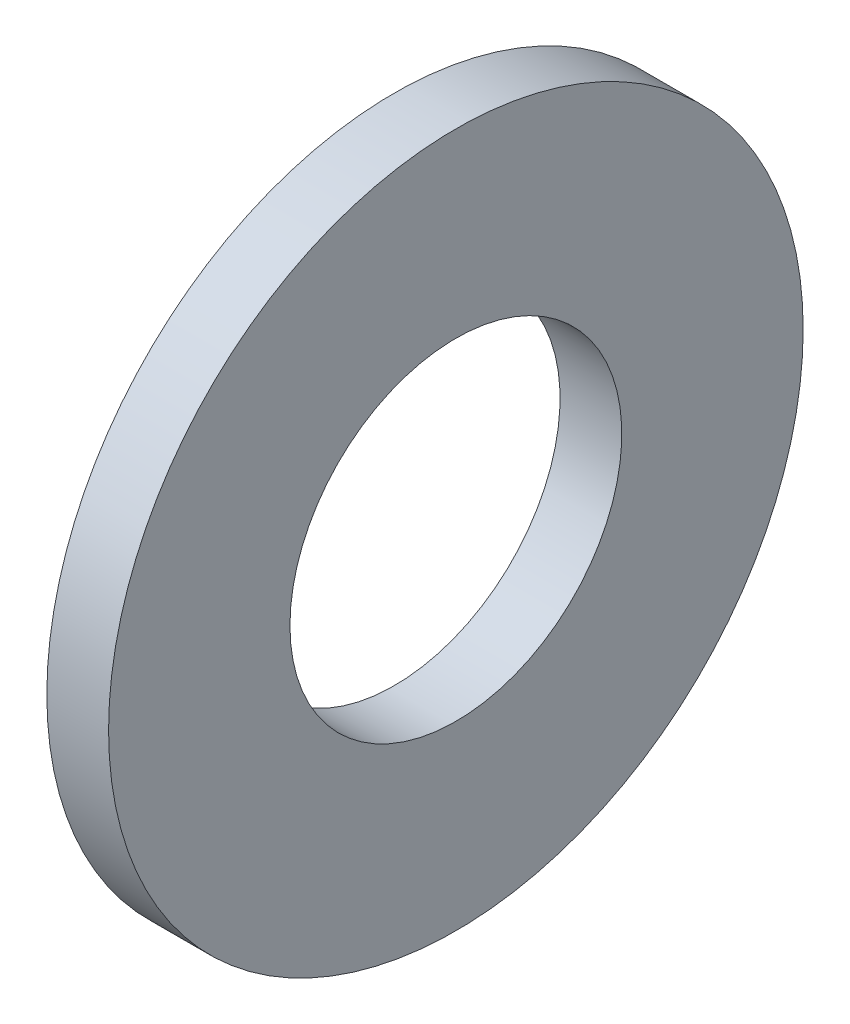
from build123d import *

# Parameters (mm, degrees)
SKETCH1_W = 0.8
SKETCH1_H = 2.35


with BuildPart() as part:
    # Sketch1 → Base-Revolve (revolve)
    with BuildSketch(Plane.XY, mode=Mode.PRIVATE) as base_revolve_sk:
        with Locations((-0.4, 3.325)):
            Rectangle(SKETCH1_W, SKETCH1_H)
    revolve(base_revolve_sk.sketch.rotate(Axis((-34.925, 0, 0), (1, 0, 0)), 89.999999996), axis=Axis((-34.925, 0, 0), (1, 0, 0)))


solid = part.part
